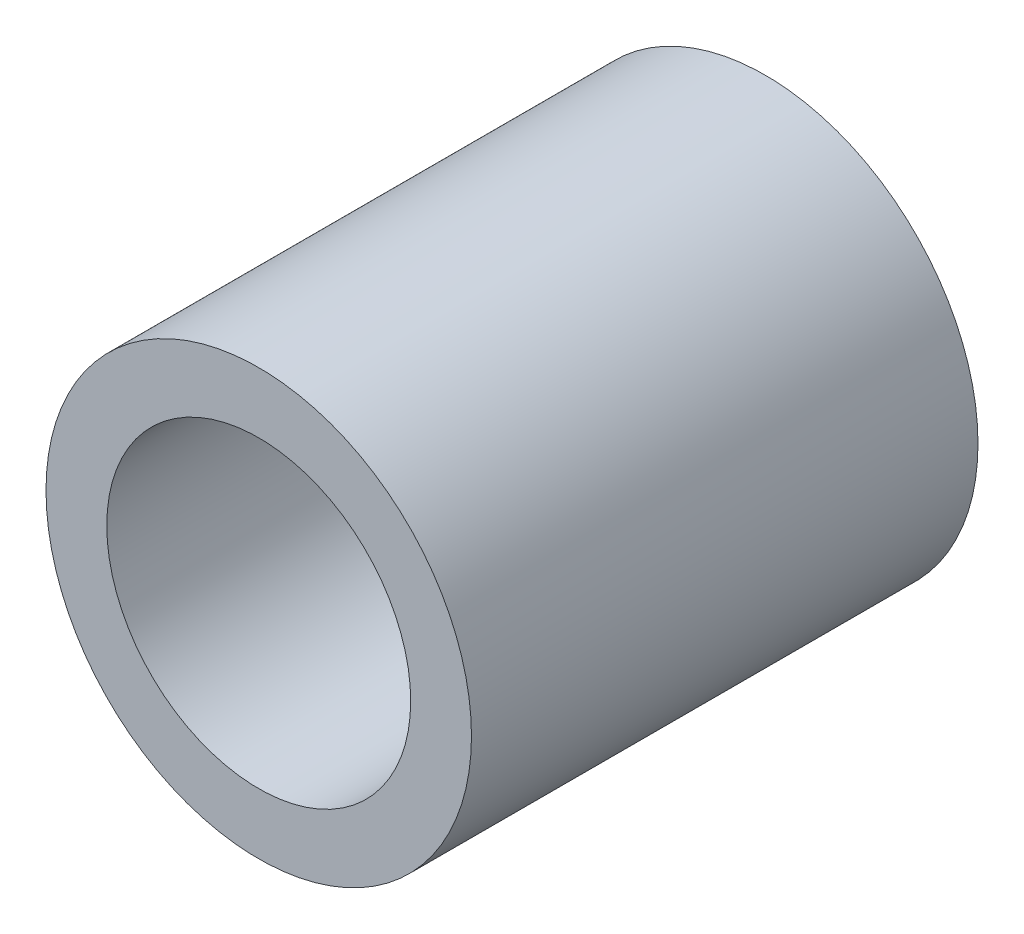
from build123d import *

# Parameters (mm, degrees)
PIPESKETCH_R   = 10.668
PIPESKETCH_R_2 = 7.62
EXTRUDE1_DEPTH = 25.4


with BuildPart() as part:
    # PipeSketch → Extrude1 (new body)
    with BuildSketch(Plane.XY):
        Circle(PIPESKETCH_R)
        Circle(PIPESKETCH_R_2, mode=Mode.SUBTRACT)
    extrude(amount=EXTRUDE1_DEPTH)


solid = part.part
